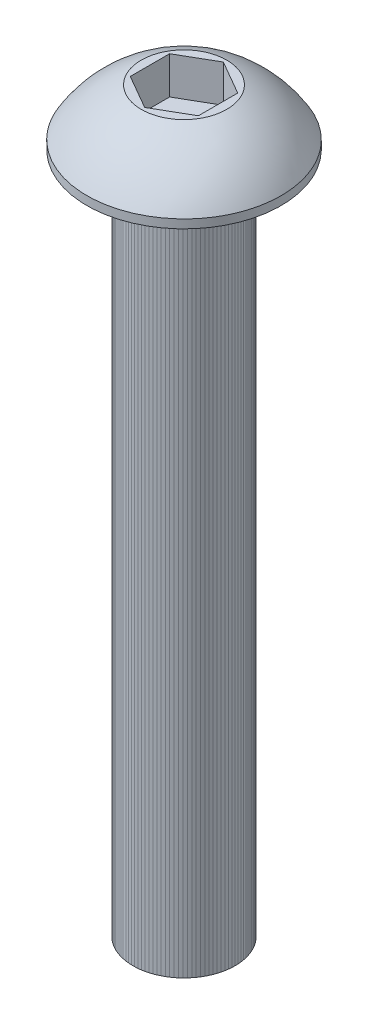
ISO-10303-21;
HEADER;
FILE_DESCRIPTION(('STEP AP214'),'2;1');
FILE_NAME('part.step','',(''),(''),'','','');
FILE_SCHEMA(('AUTOMOTIVE_DESIGN { 1 0 10303 214 1 1 1 1 }'));
ENDSEC;
DATA;
#1=APPLICATION_CONTEXT('core data for automotive mechanical design processes');
#2=APPLICATION_PROTOCOL_DEFINITION('international standard','automotive_design',2000,#1);
#3=PRODUCT_CONTEXT('',#1,'mechanical');
#4=PRODUCT('Part','Part','',(#3));
#5=PRODUCT_RELATED_PRODUCT_CATEGORY('part','',(#4));
#6=PRODUCT_DEFINITION_FORMATION('','',#4);
#7=PRODUCT_DEFINITION_CONTEXT('part definition',#1,'design');
#8=PRODUCT_DEFINITION('design','',#6,#7);
#9=PRODUCT_DEFINITION_SHAPE('','',#8);
#10=(LENGTH_UNIT() NAMED_UNIT(*) SI_UNIT(.MILLI.,.METRE.));
#11=(NAMED_UNIT(*) PLANE_ANGLE_UNIT() SI_UNIT($,.RADIAN.));
#12=(NAMED_UNIT(*) SI_UNIT($,.STERADIAN.) SOLID_ANGLE_UNIT());
#13=UNCERTAINTY_MEASURE_WITH_UNIT(LENGTH_MEASURE(1.E-05),#10,'distance_accuracy_value','');
#14=(GEOMETRIC_REPRESENTATION_CONTEXT(3) GLOBAL_UNCERTAINTY_ASSIGNED_CONTEXT((#13)) GLOBAL_UNIT_ASSIGNED_CONTEXT((#10,
#11,#12)) REPRESENTATION_CONTEXT('',''));
#15=CARTESIAN_POINT('',(0.,0.,0.));
#16=DIRECTION('',(0.,0.,1.));
#17=DIRECTION('',(1.,0.,0.));
#18=AXIS2_PLACEMENT_3D('',#15,#16,#17);
#19=CARTESIAN_POINT('',(0.,-20.,0.));
#20=DIRECTION('',(0.,1.,0.));
#21=DIRECTION('',(0.,0.,1.));
#22=AXIS2_PLACEMENT_3D('',#19,#20,#21);
#23=CYLINDRICAL_SURFACE('',#22,1.5);
#24=CARTESIAN_POINT('',(0.,0.,0.));
#25=DIRECTION('',(0.,1.,0.));
#26=DIRECTION('',(0.,0.,1.));
#27=AXIS2_PLACEMENT_3D('',#24,#25,#26);
#28=CIRCLE('',#27,1.5);
#29=CARTESIAN_POINT('',(0.,0.,1.5));
#30=VERTEX_POINT('',#29);
#31=EDGE_CURVE('P0_E16',#30,#30,#28,.F.);
#32=ORIENTED_EDGE('',*,*,#31,.T.);
#33=EDGE_LOOP('',(#32));
#34=FACE_BOUND('',#33,.T.);
#35=CARTESIAN_POINT('',(0.,-20.,0.));
#36=DIRECTION('',(0.,1.,0.));
#37=DIRECTION('',(0.,0.,1.));
#38=AXIS2_PLACEMENT_3D('',#35,#36,#37);
#39=CIRCLE('',#38,1.5);
#40=CARTESIAN_POINT('',(0.,-20.,1.5));
#41=VERTEX_POINT('',#40);
#42=EDGE_CURVE('P0_E10',#41,#41,#39,.T.);
#43=ORIENTED_EDGE('',*,*,#42,.T.);
#44=EDGE_LOOP('',(#43));
#45=FACE_BOUND('',#44,.T.);
#46=ADVANCED_FACE('P0_F15',(#34,#45),#23,.T.);
#47=OPEN_SHELL('',(#46));
#48=SHELL_BASED_SURFACE_MODEL('P0_B1',(#47));
#49=CARTESIAN_POINT('',(0.,0.55,0.));
#50=DIRECTION('',(0.,1.,0.));
#51=DIRECTION('',(0.,0.,1.));
#52=AXIS2_PLACEMENT_3D('',#49,#50,#51);
#53=PLANE('',#52);
#54=DIRECTION('',(0.866025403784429,0.,0.500000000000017));
#55=VECTOR('',#54,1.);
#56=CARTESIAN_POINT('',(-1.,0.55,0.5773502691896));
#57=LINE('',#56,#55);
#58=CARTESIAN_POINT('',(-1.,0.55,0.5773502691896));
#59=VERTEX_POINT('',#58);
#60=CARTESIAN_POINT('',(0.,0.55,1.15470053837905));
#61=VERTEX_POINT('',#60);
#62=EDGE_CURVE('P1_E92',#59,#61,#57,.T.);
#63=ORIENTED_EDGE('',*,*,#62,.T.);
#64=DIRECTION('',(0.866025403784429,0.,-0.500000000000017));
#65=VECTOR('',#64,1.);
#66=CARTESIAN_POINT('',(0.,0.55,1.154700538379));
#67=LINE('',#66,#65);
#68=CARTESIAN_POINT('',(0.999999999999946,0.55,0.577350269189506));
#69=VERTEX_POINT('',#68);
#70=EDGE_CURVE('P1_E89',#61,#69,#67,.T.);
#71=ORIENTED_EDGE('',*,*,#70,.T.);
#72=DIRECTION('',(0.,0.,-1.));
#73=VECTOR('',#72,1.);
#74=CARTESIAN_POINT('',(1.,0.55,0.5773502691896));
#75=LINE('',#74,#73);
#76=CARTESIAN_POINT('',(1.,0.55,-0.5773502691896));
#77=VERTEX_POINT('',#76);
#78=EDGE_CURVE('P1_E85',#69,#77,#75,.T.);
#79=ORIENTED_EDGE('',*,*,#78,.T.);
#80=DIRECTION('',(-0.866025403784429,0.,-0.500000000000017));
#81=VECTOR('',#80,1.);
#82=CARTESIAN_POINT('',(1.,0.55,-0.5773502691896));
#83=LINE('',#82,#81);
#84=CARTESIAN_POINT('',(0.,0.55,-1.15470053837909));
#85=VERTEX_POINT('',#84);
#86=EDGE_CURVE('P1_E115',#77,#85,#83,.T.);
#87=ORIENTED_EDGE('',*,*,#86,.T.);
#88=DIRECTION('',(-0.866025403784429,0.,0.500000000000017));
#89=VECTOR('',#88,1.);
#90=CARTESIAN_POINT('',(0.,0.55,-1.154700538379));
#91=LINE('',#90,#89);
#92=CARTESIAN_POINT('',(-0.999999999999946,0.55,-0.577350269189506));
#93=VERTEX_POINT('',#92);
#94=EDGE_CURVE('P1_E170',#85,#93,#91,.T.);
#95=ORIENTED_EDGE('',*,*,#94,.T.);
#96=DIRECTION('',(0.,0.,1.));
#97=VECTOR('',#96,1.);
#98=CARTESIAN_POINT('',(-1.,0.55,-0.5773502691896));
#99=LINE('',#98,#97);
#100=EDGE_CURVE('P1_E164',#93,#59,#99,.T.);
#101=ORIENTED_EDGE('',*,*,#100,.T.);
#102=EDGE_LOOP('',(#63,#71,#79,#87,#95,#101));
#103=FACE_BOUND('',#102,.T.);
#104=ADVANCED_FACE('P1_F17',(#103),#53,.T.);
#105=CARTESIAN_POINT('',(0.,1.65,1.154700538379));
#106=DIRECTION('',(0.500000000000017,0.,0.866025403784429));
#107=DIRECTION('',(0.866025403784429,0.,-0.500000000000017));
#108=AXIS2_PLACEMENT_3D('',#105,#106,#107);
#109=PLANE('',#108);
#110=ORIENTED_EDGE('',*,*,#70,.F.);
#111=DIRECTION('',(0.,1.,0.));
#112=VECTOR('',#111,1.);
#113=CARTESIAN_POINT('',(-1.08637057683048E-13,1.65,1.15470053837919));
#114=LINE('',#113,#112);
#115=CARTESIAN_POINT('',(0.,1.65,1.15470053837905));
#116=VERTEX_POINT('',#115);
#117=EDGE_CURVE('P1_E156',#61,#116,#114,.T.);
#118=ORIENTED_EDGE('',*,*,#117,.T.);
#119=DIRECTION('',(0.866025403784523,0.,-0.499999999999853));
#120=VECTOR('',#119,1.);
#121=CARTESIAN_POINT('',(0.,1.65,1.154700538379));
#122=LINE('',#121,#120);
#123=CARTESIAN_POINT('',(0.999999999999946,1.65,0.577350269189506));
#124=VERTEX_POINT('',#123);
#125=EDGE_CURVE('P1_E101',#116,#124,#122,.T.);
#126=ORIENTED_EDGE('',*,*,#125,.T.);
#127=DIRECTION('',(0.,1.,0.));
#128=VECTOR('',#127,1.);
#129=CARTESIAN_POINT('',(1.,1.65,0.5773502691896));
#130=LINE('',#129,#128);
#131=EDGE_CURVE('P1_E96',#124,#69,#130,.F.);
#132=ORIENTED_EDGE('',*,*,#131,.T.);
#133=EDGE_LOOP('',(#110,#118,#126,#132));
#134=FACE_BOUND('',#133,.T.);
#135=ADVANCED_FACE('P1_F99',(#134),#109,.F.);
#136=CARTESIAN_POINT('',(1.,1.65,0.5773502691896));
#137=DIRECTION('',(1.,0.,0.));
#138=DIRECTION('',(0.,0.,-1.));
#139=AXIS2_PLACEMENT_3D('',#136,#137,#138);
#140=PLANE('',#139);
#141=ORIENTED_EDGE('',*,*,#78,.F.);
#142=ORIENTED_EDGE('',*,*,#131,.F.);
#143=DIRECTION('',(0.,0.,-1.));
#144=VECTOR('',#143,1.);
#145=CARTESIAN_POINT('',(1.,1.65,0.));
#146=LINE('',#145,#144);
#147=CARTESIAN_POINT('',(1.,1.65,-0.5773502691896));
#148=VERTEX_POINT('',#147);
#149=EDGE_CURVE('P1_E152',#124,#148,#146,.T.);
#150=ORIENTED_EDGE('',*,*,#149,.T.);
#151=DIRECTION('',(0.,1.,0.));
#152=VECTOR('',#151,1.);
#153=CARTESIAN_POINT('',(1.,1.65,-0.5773502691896));
#154=LINE('',#153,#152);
#155=EDGE_CURVE('P1_E108',#148,#77,#154,.F.);
#156=ORIENTED_EDGE('',*,*,#155,.T.);
#157=EDGE_LOOP('',(#141,#142,#150,#156));
#158=FACE_BOUND('',#157,.T.);
#159=ADVANCED_FACE('P1_F106',(#158),#140,.F.);
#160=CARTESIAN_POINT('',(1.,1.65,-0.5773502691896));
#161=DIRECTION('',(0.500000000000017,0.,-0.866025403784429));
#162=DIRECTION('',(-0.866025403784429,0.,-0.500000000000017));
#163=AXIS2_PLACEMENT_3D('',#160,#161,#162);
#164=PLANE('',#163);
#165=ORIENTED_EDGE('',*,*,#86,.F.);
#166=ORIENTED_EDGE('',*,*,#155,.F.);
#167=DIRECTION('',(-0.866025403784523,0.,-0.499999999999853));
#168=VECTOR('',#167,1.);
#169=CARTESIAN_POINT('',(1.,1.65,-0.5773502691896));
#170=LINE('',#169,#168);
#171=CARTESIAN_POINT('',(0.,1.65,-1.15470053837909));
#172=VERTEX_POINT('',#171);
#173=EDGE_CURVE('P1_E150',#148,#172,#170,.T.);
#174=ORIENTED_EDGE('',*,*,#173,.T.);
#175=DIRECTION('',(0.,1.,0.));
#176=VECTOR('',#175,1.);
#177=CARTESIAN_POINT('',(0.,1.65,-1.154700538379));
#178=LINE('',#177,#176);
#179=EDGE_CURVE('P1_E173',#172,#85,#178,.F.);
#180=ORIENTED_EDGE('',*,*,#179,.T.);
#181=EDGE_LOOP('',(#165,#166,#174,#180));
#182=FACE_BOUND('',#181,.T.);
#183=ADVANCED_FACE('P1_F180',(#182),#164,.F.);
#184=CARTESIAN_POINT('',(0.,1.65,-1.154700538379));
#185=DIRECTION('',(-0.500000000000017,0.,-0.866025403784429));
#186=DIRECTION('',(-0.866025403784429,0.,0.500000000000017));
#187=AXIS2_PLACEMENT_3D('',#184,#185,#186);
#188=PLANE('',#187);
#189=ORIENTED_EDGE('',*,*,#94,.F.);
#190=ORIENTED_EDGE('',*,*,#179,.F.);
#191=DIRECTION('',(-0.866025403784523,0.,0.499999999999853));
#192=VECTOR('',#191,1.);
#193=CARTESIAN_POINT('',(0.,1.65,-1.154700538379));
#194=LINE('',#193,#192);
#195=CARTESIAN_POINT('',(-0.999999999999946,1.65,-0.577350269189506));
#196=VERTEX_POINT('',#195);
#197=EDGE_CURVE('P1_E144',#172,#196,#194,.T.);
#198=ORIENTED_EDGE('',*,*,#197,.T.);
#199=DIRECTION('',(0.,1.,0.));
#200=VECTOR('',#199,1.);
#201=CARTESIAN_POINT('',(-1.,1.65,-0.5773502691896));
#202=LINE('',#201,#200);
#203=EDGE_CURVE('P1_E166',#196,#93,#202,.F.);
#204=ORIENTED_EDGE('',*,*,#203,.T.);
#205=EDGE_LOOP('',(#189,#190,#198,#204));
#206=FACE_BOUND('',#205,.T.);
#207=ADVANCED_FACE('P1_F184',(#206),#188,.F.);
#208=CARTESIAN_POINT('',(-1.,1.65,-0.5773502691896));
#209=DIRECTION('',(-1.,0.,0.));
#210=DIRECTION('',(0.,0.,1.));
#211=AXIS2_PLACEMENT_3D('',#208,#209,#210);
#212=PLANE('',#211);
#213=ORIENTED_EDGE('',*,*,#100,.F.);
#214=ORIENTED_EDGE('',*,*,#203,.F.);
#215=DIRECTION('',(0.,0.,-1.));
#216=VECTOR('',#215,1.);
#217=CARTESIAN_POINT('',(-1.,1.65,0.));
#218=LINE('',#217,#216);
#219=CARTESIAN_POINT('',(-1.,1.65,0.5773502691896));
#220=VERTEX_POINT('',#219);
#221=EDGE_CURVE('P1_E44',#196,#220,#218,.F.);
#222=ORIENTED_EDGE('',*,*,#221,.T.);
#223=DIRECTION('',(0.,1.,0.));
#224=VECTOR('',#223,1.);
#225=CARTESIAN_POINT('',(-1.,1.65,0.5773502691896));
#226=LINE('',#225,#224);
#227=EDGE_CURVE('P1_E161',#220,#59,#226,.F.);
#228=ORIENTED_EDGE('',*,*,#227,.T.);
#229=EDGE_LOOP('',(#213,#214,#222,#228));
#230=FACE_BOUND('',#229,.T.);
#231=ADVANCED_FACE('P1_F186',(#230),#212,.F.);
#232=CARTESIAN_POINT('',(-1.,1.65,0.5773502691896));
#233=DIRECTION('',(-0.500000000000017,0.,0.866025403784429));
#234=DIRECTION('',(0.866025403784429,0.,0.500000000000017));
#235=AXIS2_PLACEMENT_3D('',#232,#233,#234);
#236=PLANE('',#235);
#237=ORIENTED_EDGE('',*,*,#62,.F.);
#238=ORIENTED_EDGE('',*,*,#227,.F.);
#239=DIRECTION('',(0.866025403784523,0.,0.499999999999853));
#240=VECTOR('',#239,1.);
#241=CARTESIAN_POINT('',(-1.,1.65,0.5773502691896));
#242=LINE('',#241,#240);
#243=EDGE_CURVE('P1_E133',#220,#116,#242,.T.);
#244=ORIENTED_EDGE('',*,*,#243,.T.);
#245=ORIENTED_EDGE('',*,*,#117,.F.);
#246=EDGE_LOOP('',(#237,#238,#244,#245));
#247=FACE_BOUND('',#246,.T.);
#248=ADVANCED_FACE('P1_F187',(#247),#236,.F.);
#249=CARTESIAN_POINT('',(0.,1.65,0.));
#250=DIRECTION('',(0.,-1.,0.));
#251=DIRECTION('',(0.,0.,-1.));
#252=AXIS2_PLACEMENT_3D('',#249,#250,#251);
#253=PLANE('',#252);
#254=ORIENTED_EDGE('',*,*,#221,.F.);
#255=ORIENTED_EDGE('',*,*,#197,.F.);
#256=ORIENTED_EDGE('',*,*,#173,.F.);
#257=ORIENTED_EDGE('',*,*,#149,.F.);
#258=ORIENTED_EDGE('',*,*,#125,.F.);
#259=ORIENTED_EDGE('',*,*,#243,.F.);
#260=EDGE_LOOP('',(#254,#255,#256,#257,#258,#259));
#261=FACE_BOUND('',#260,.T.);
#262=CARTESIAN_POINT('',(-1.25470053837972,1.65,0.));
#263=CARTESIAN_POINT('',(-1.2546965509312,1.64999999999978,-0.070424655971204));
#264=CARTESIAN_POINT('',(-1.24873864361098,1.64999999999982,-0.140974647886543));
#265=CARTESIAN_POINT('',(-1.23101016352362,1.65000000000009,-0.245237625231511));
#266=CARTESIAN_POINT('',(-1.22361994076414,1.65000000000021,-0.279775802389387));
#267=CARTESIAN_POINT('',(-1.20595086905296,1.64999999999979,-0.348140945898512));
#268=CARTESIAN_POINT('',(-1.19566967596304,1.64999999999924,-0.381967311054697));
#269=CARTESIAN_POINT('',(-1.16063107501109,1.64999999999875,-0.481845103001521));
#270=CARTESIAN_POINT('',(-1.13164986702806,1.64999999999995,-0.546463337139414));
#271=CARTESIAN_POINT('',(-1.0632361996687,1.65000000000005,-0.669911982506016));
#272=CARTESIAN_POINT('',(-1.02380334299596,1.64999999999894,-0.728742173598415));
#273=CARTESIAN_POINT('',(-0.957707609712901,1.64999999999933,-0.811368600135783));
#274=CARTESIAN_POINT('',(-0.934500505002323,1.6499999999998,-0.837989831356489));
#275=CARTESIAN_POINT('',(-0.885952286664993,1.6500000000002,-0.889159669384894));
#276=CARTESIAN_POINT('',(-0.86061325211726,1.65000000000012,-0.913710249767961));
#277=CARTESIAN_POINT('',(-0.78160082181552,1.64999999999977,-0.984041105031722));
#278=CARTESIAN_POINT('',(-0.724917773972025,1.6499999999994,-1.02651836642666));
#279=CARTESIAN_POINT('',(-0.605255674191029,1.64999999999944,-1.10132851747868));
#280=CARTESIAN_POINT('',(-0.542276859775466,1.64999999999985,-1.13366178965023));
#281=CARTESIAN_POINT('',(-0.411777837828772,1.65000000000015,-1.18730210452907));
#282=CARTESIAN_POINT('',(-0.344257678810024,1.65000000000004,-1.20860926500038));
#283=CARTESIAN_POINT('',(-0.206600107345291,1.64999999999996,-1.23958383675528));
#284=CARTESIAN_POINT('',(-0.136462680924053,1.64999999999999,-1.24925118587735));
#285=CARTESIAN_POINT('',(0.00443971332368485,1.65000000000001,-1.2566745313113));
#286=CARTESIAN_POINT('',(0.075204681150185,1.65,-1.25443052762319));
#287=CARTESIAN_POINT('',(0.21535490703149,1.65,-1.23809206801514));
#288=CARTESIAN_POINT('',(0.284740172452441,1.65,-1.22399767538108));
#289=CARTESIAN_POINT('',(0.42015312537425,1.65,-1.18436674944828));
#290=CARTESIAN_POINT('',(0.486180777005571,1.65,-1.1588300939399));
#291=CARTESIAN_POINT('',(0.613041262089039,1.65,-1.09700781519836));
#292=CARTESIAN_POINT('',(0.673873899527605,1.65,-1.06072178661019));
#293=CARTESIAN_POINT('',(0.759839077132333,1.65,-0.999082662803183));
#294=CARTESIAN_POINT('',(0.787617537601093,1.65,-0.977330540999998));
#295=CARTESIAN_POINT('',(0.8412737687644,1.65,-0.931545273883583));
#296=CARTESIAN_POINT('',(0.867149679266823,1.64999999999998,-0.907509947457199));
#297=CARTESIAN_POINT('',(0.941561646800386,1.65000000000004,-0.832286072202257));
#298=CARTESIAN_POINT('',(0.986957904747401,1.6500000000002,-0.7779250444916));
#299=CARTESIAN_POINT('',(1.06796444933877,1.6499999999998,-0.662348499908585));
#300=CARTESIAN_POINT('',(1.1035751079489,1.64999999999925,-0.601133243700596));
#301=CARTESIAN_POINT('',(1.1489145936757,1.64999999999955,-0.505490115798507));
#302=CARTESIAN_POINT('',(1.16269324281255,1.64999999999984,-0.472931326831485));
#303=CARTESIAN_POINT('',(1.18744810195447,1.65000000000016,-0.406801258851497));
#304=CARTESIAN_POINT('',(1.19842657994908,1.65000000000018,-0.373230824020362));
#305=CARTESIAN_POINT('',(1.22701255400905,1.64999999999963,-0.271407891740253));
#306=CARTESIAN_POINT('',(1.24035065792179,1.64999999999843,-0.201874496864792));
#307=CARTESIAN_POINT('',(1.25006989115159,1.64999999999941,-0.109940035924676));
#308=CARTESIAN_POINT('',(1.25180488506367,1.64999999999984,-0.0879909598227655));
#309=CARTESIAN_POINT('',(1.25412083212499,1.65000000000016,-0.0440320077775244));
#310=CARTESIAN_POINT('',(1.25470178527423,1.65000000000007,-0.0220221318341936));
#311=CARTESIAN_POINT('',(1.2546965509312,1.64999999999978,0.0704246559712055));
#312=CARTESIAN_POINT('',(1.24873864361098,1.64999999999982,0.140974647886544));
#313=CARTESIAN_POINT('',(1.23101016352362,1.65000000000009,0.245237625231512));
#314=CARTESIAN_POINT('',(1.22361994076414,1.65000000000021,0.279775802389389));
#315=CARTESIAN_POINT('',(1.20595086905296,1.64999999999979,0.348140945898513));
#316=CARTESIAN_POINT('',(1.19566967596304,1.64999999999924,0.381967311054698));
#317=CARTESIAN_POINT('',(1.16063107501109,1.64999999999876,0.481845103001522));
#318=CARTESIAN_POINT('',(1.13164986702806,1.64999999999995,0.546463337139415));
#319=CARTESIAN_POINT('',(1.0632361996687,1.65000000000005,0.669911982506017));
#320=CARTESIAN_POINT('',(1.02380334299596,1.64999999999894,0.728742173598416));
#321=CARTESIAN_POINT('',(0.9577076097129,1.64999999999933,0.811368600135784));
#322=CARTESIAN_POINT('',(0.934500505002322,1.6499999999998,0.83798983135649));
#323=CARTESIAN_POINT('',(0.885952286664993,1.6500000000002,0.889159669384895));
#324=CARTESIAN_POINT('',(0.860613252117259,1.65000000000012,0.913710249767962));
#325=CARTESIAN_POINT('',(0.781600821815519,1.64999999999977,0.984041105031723));
#326=CARTESIAN_POINT('',(0.724917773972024,1.6499999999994,1.02651836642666));
#327=CARTESIAN_POINT('',(0.605255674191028,1.64999999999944,1.10132851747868));
#328=CARTESIAN_POINT('',(0.542276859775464,1.64999999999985,1.13366178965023));
#329=CARTESIAN_POINT('',(0.411777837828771,1.65000000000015,1.18730210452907));
#330=CARTESIAN_POINT('',(0.344257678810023,1.65000000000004,1.20860926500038));
#331=CARTESIAN_POINT('',(0.20660010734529,1.64999999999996,1.23958383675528));
#332=CARTESIAN_POINT('',(0.136462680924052,1.64999999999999,1.24925118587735));
#333=CARTESIAN_POINT('',(-0.00443971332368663,1.65000000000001,1.2566745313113));
#334=CARTESIAN_POINT('',(-0.0752046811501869,1.65,1.25443052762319));
#335=CARTESIAN_POINT('',(-0.215354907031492,1.65,1.23809206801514));
#336=CARTESIAN_POINT('',(-0.284740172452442,1.65,1.22399767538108));
#337=CARTESIAN_POINT('',(-0.420153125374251,1.65,1.18436674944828));
#338=CARTESIAN_POINT('',(-0.486180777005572,1.65,1.1588300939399));
#339=CARTESIAN_POINT('',(-0.61304126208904,1.65,1.09700781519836));
#340=CARTESIAN_POINT('',(-0.673873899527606,1.65,1.06072178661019));
#341=CARTESIAN_POINT('',(-0.759839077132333,1.65,0.999082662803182));
#342=CARTESIAN_POINT('',(-0.787617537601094,1.65000000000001,0.977330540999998));
#343=CARTESIAN_POINT('',(-0.8412737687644,1.64999999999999,0.931545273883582));
#344=CARTESIAN_POINT('',(-0.867149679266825,1.64999999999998,0.907509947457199));
#345=CARTESIAN_POINT('',(-0.941561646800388,1.65000000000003,0.832286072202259));
#346=CARTESIAN_POINT('',(-0.986957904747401,1.6500000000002,0.7779250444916));
#347=CARTESIAN_POINT('',(-1.06796444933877,1.6499999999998,0.662348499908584));
#348=CARTESIAN_POINT('',(-1.10357510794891,1.64999999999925,0.601133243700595));
#349=CARTESIAN_POINT('',(-1.1489145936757,1.64999999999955,0.505490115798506));
#350=CARTESIAN_POINT('',(-1.16269324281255,1.64999999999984,0.472931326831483));
#351=CARTESIAN_POINT('',(-1.18744810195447,1.65000000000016,0.406801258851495));
#352=CARTESIAN_POINT('',(-1.19842657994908,1.65000000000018,0.373230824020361));
#353=CARTESIAN_POINT('',(-1.22701255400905,1.64999999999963,0.271407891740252));
#354=CARTESIAN_POINT('',(-1.24035065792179,1.64999999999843,0.20187449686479));
#355=CARTESIAN_POINT('',(-1.25006989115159,1.64999999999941,0.109940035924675));
#356=CARTESIAN_POINT('',(-1.25180488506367,1.64999999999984,0.0879909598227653));
#357=CARTESIAN_POINT('',(-1.25412083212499,1.65000000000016,0.0440320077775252));
#358=CARTESIAN_POINT('',(-1.25470178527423,1.65000000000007,0.0220221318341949));
#359=CARTESIAN_POINT('',(-1.25470053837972,1.65,0.));
#360=B_SPLINE_CURVE_WITH_KNOTS('',3,(#262,#263,#264,#265,#266,#267,#268,#269,#270,#271,#272,
#273,#274,#275,#276,#277,#278,#279,#280,#281,#282,#283,#284,#285,#286,#287,#288,#289,#290,#291,
#292,#293,#294,#295,#296,#297,#298,#299,#300,#301,#302,#303,#304,#305,#306,#307,#308,#309,#310,
#311,#312,#313,#314,#315,#316,#317,#318,#319,#320,#321,#322,#323,#324,#325,#326,#327,#328,#329,
#330,#331,#332,#333,#334,#335,#336,#337,#338,#339,#340,#341,#342,#343,#344,#345,#346,#347,#348,
#349,#350,#351,#352,#353,#354,#355,#356,#357,#358,#359),.UNSPECIFIED.,.T.,.F.,(4,2,2,2,2,2,2,2,
2,2,2,2,2,2,2,2,2,2,2,2,2,2,2,2,2,2,2,2,2,2,2,2,2,2,2,2,2,2,2,2,2,2,2,2,2,2,2,2,4),(0.,
0.211171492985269,0.317034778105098,0.422984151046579,0.634377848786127,0.84577958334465,
0.951618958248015,1.05735628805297,1.26876310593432,1.48016195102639,1.6915585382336,
1.90295625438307,2.1143539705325,2.32575055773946,2.53714940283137,2.74855622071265,
2.85429355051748,2.96013292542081,3.17153465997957,3.38292835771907,3.48887773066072,
3.59474101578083,3.80591250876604,3.87194685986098,3.93798121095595,4.14915270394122,
4.25501598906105,4.36096536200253,4.57235905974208,4.7837607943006,4.88960016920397,
4.99533749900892,5.20674431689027,5.41814316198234,5.62953974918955,5.84093746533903,
6.05233518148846,6.26373176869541,6.47513061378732,6.68653743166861,6.79227476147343,
6.89811413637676,7.10951587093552,7.32090956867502,7.42685894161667,7.53272222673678,
7.74389371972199,7.80992807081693,7.8759624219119),.UNSPECIFIED.);
#361=CARTESIAN_POINT('',(-1.25470053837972,1.65,0.));
#362=VERTEX_POINT('',#361);
#363=EDGE_CURVE('P1_E20',#362,#362,#360,.T.);
#364=ORIENTED_EDGE('',*,*,#363,.F.);
#365=EDGE_LOOP('',(#364));
#366=FACE_BOUND('',#365,.T.);
#367=ADVANCED_FACE('P1_F189',(#261,#366),#253,.F.);
#368=CARTESIAN_POINT('',(0.,-1.39317183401,0.));
#369=DIRECTION('',(-1.,0.,0.));
#370=DIRECTION('',(0.,0.,-1.));
#371=AXIS2_PLACEMENT_3D('',#368,#369,#370);
#372=SPHERICAL_SURFACE('',#371,3.291681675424);
#373=ORIENTED_EDGE('',*,*,#363,.T.);
#374=EDGE_LOOP('',(#373));
#375=FACE_BOUND('',#374,.T.);
#376=CARTESIAN_POINT('',(0.,0.2538461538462,0.));
#377=DIRECTION('',(0.,-1.,0.));
#378=DIRECTION('',(0.,0.,-1.));
#379=AXIS2_PLACEMENT_3D('',#376,#377,#378);
#380=CIRCLE('',#379,2.85);
#381=CARTESIAN_POINT('',(0.,0.2538461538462,-2.85));
#382=VERTEX_POINT('',#381);
#383=EDGE_CURVE('P1_E124',#382,#382,#380,.T.);
#384=ORIENTED_EDGE('',*,*,#383,.F.);
#385=EDGE_LOOP('',(#384));
#386=FACE_BOUND('',#385,.T.);
#387=ADVANCED_FACE('P1_F196',(#375,#386),#372,.T.);
#388=CARTESIAN_POINT('',(0.,1.993435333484,0.));
#389=DIRECTION('',(0.,-1.,0.));
#390=DIRECTION('',(0.,0.,-1.));
#391=AXIS2_PLACEMENT_3D('',#388,#389,#390);
#392=CYLINDRICAL_SURFACE('',#391,2.85);
#393=ORIENTED_EDGE('',*,*,#383,.T.);
#394=EDGE_LOOP('',(#393));
#395=FACE_BOUND('',#394,.T.);
#396=CARTESIAN_POINT('',(0.,0.,0.));
#397=DIRECTION('',(0.,-1.,0.));
#398=DIRECTION('',(0.,0.,-1.));
#399=AXIS2_PLACEMENT_3D('',#396,#397,#398);
#400=CIRCLE('',#399,2.85);
#401=CARTESIAN_POINT('',(0.,0.,-2.85));
#402=VERTEX_POINT('',#401);
#403=EDGE_CURVE('P1_E122',#402,#402,#400,.T.);
#404=ORIENTED_EDGE('',*,*,#403,.F.);
#405=EDGE_LOOP('',(#404));
#406=FACE_BOUND('',#405,.T.);
#407=ADVANCED_FACE('P1_F214',(#395,#406),#392,.T.);
#408=CARTESIAN_POINT('',(0.,-20.,0.));
#409=DIRECTION('',(0.,-1.,0.));
#410=DIRECTION('',(0.,0.,-1.));
#411=AXIS2_PLACEMENT_3D('',#408,#409,#410);
#412=PLANE('',#411);
#413=CARTESIAN_POINT('',(0.,-20.,0.));
#414=DIRECTION('',(0.,-1.,0.));
#415=DIRECTION('',(0.,0.,-1.));
#416=AXIS2_PLACEMENT_3D('',#413,#414,#415);
#417=CIRCLE('',#416,1.5);
#418=CARTESIAN_POINT('',(0.,-20.,-1.5));
#419=VERTEX_POINT('',#418);
#420=EDGE_CURVE('P1_E31',#419,#419,#417,.F.);
#421=ORIENTED_EDGE('',*,*,#420,.F.);
#422=EDGE_LOOP('',(#421));
#423=FACE_BOUND('',#422,.T.);
#424=ADVANCED_FACE('P1_F207',(#423),#412,.T.);
#425=CARTESIAN_POINT('',(0.,0.,0.));
#426=DIRECTION('',(0.,-1.,0.));
#427=DIRECTION('',(0.,0.,-1.));
#428=AXIS2_PLACEMENT_3D('',#425,#426,#427);
#429=PLANE('',#428);
#430=CARTESIAN_POINT('',(0.,0.,0.));
#431=DIRECTION('',(0.,-1.,0.));
#432=DIRECTION('',(0.,0.,-1.));
#433=AXIS2_PLACEMENT_3D('',#430,#431,#432);
#434=CIRCLE('',#433,1.5);
#435=CARTESIAN_POINT('',(0.,0.,-1.5));
#436=VERTEX_POINT('',#435);
#437=EDGE_CURVE('P1_E11',#436,#436,#434,.T.);
#438=ORIENTED_EDGE('',*,*,#437,.F.);
#439=EDGE_LOOP('',(#438));
#440=FACE_BOUND('',#439,.T.);
#441=ORIENTED_EDGE('',*,*,#403,.T.);
#442=EDGE_LOOP('',(#441));
#443=FACE_BOUND('',#442,.T.);
#444=ADVANCED_FACE('P1_F201',(#440,#443),#429,.T.);
#445=CARTESIAN_POINT('',(0.,0.,0.));
#446=DIRECTION('',(0.,-1.,0.));
#447=DIRECTION('',(0.,0.,-1.));
#448=AXIS2_PLACEMENT_3D('',#445,#446,#447);
#449=CYLINDRICAL_SURFACE('',#448,1.5);
#450=ORIENTED_EDGE('',*,*,#420,.T.);
#451=EDGE_LOOP('',(#450));
#452=FACE_BOUND('',#451,.T.);
#453=ORIENTED_EDGE('',*,*,#437,.T.);
#454=EDGE_LOOP('',(#453));
#455=FACE_BOUND('',#454,.T.);
#456=ADVANCED_FACE('P1_F199',(#452,#455),#449,.T.);
#457=CLOSED_SHELL('',(#104,#135,#159,#183,#207,#231,#248,#367,#387,#407,#424,#444,#456));
#458=MANIFOLD_SOLID_BREP('P1_B1',#457);
#459=ADVANCED_BREP_SHAPE_REPRESENTATION('',(#18,#458),#14);
#460=MANIFOLD_SURFACE_SHAPE_REPRESENTATION('',(#18,#48),#14);
#461=SHAPE_REPRESENTATION('',(#18),#14);
#462=SHAPE_DEFINITION_REPRESENTATION(#9,#461);
#463=SHAPE_REPRESENTATION_RELATIONSHIP('','',#461,#459);
#464=SHAPE_REPRESENTATION_RELATIONSHIP('','',#461,#460);
ENDSEC;
END-ISO-10303-21;
